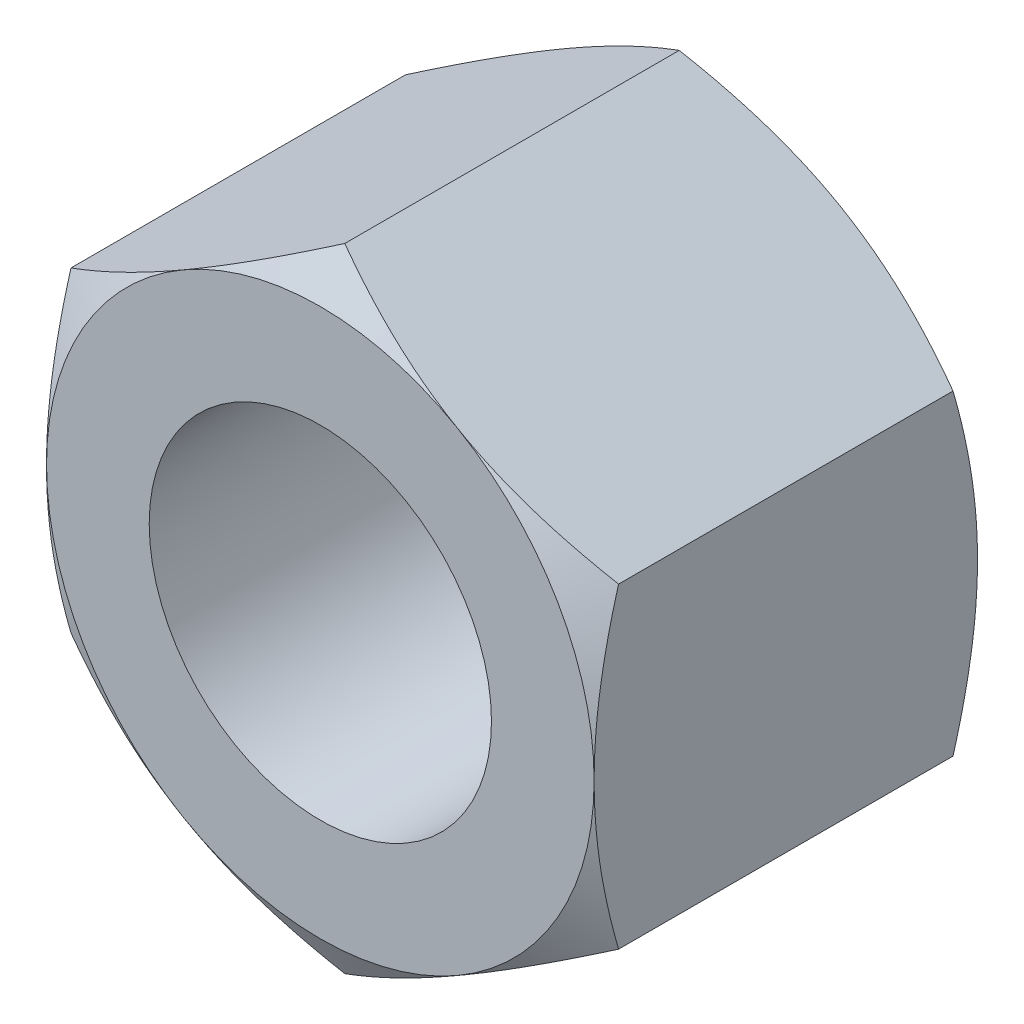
ISO-10303-21;
HEADER;
FILE_DESCRIPTION(('STEP AP214'),'2;1');
FILE_NAME('part.step','',(''),(''),'','','');
FILE_SCHEMA(('AUTOMOTIVE_DESIGN { 1 0 10303 214 1 1 1 1 }'));
ENDSEC;
DATA;
#1=APPLICATION_CONTEXT('core data for automotive mechanical design processes');
#2=APPLICATION_PROTOCOL_DEFINITION('international standard','automotive_design',2000,#1);
#3=PRODUCT_CONTEXT('',#1,'mechanical');
#4=PRODUCT('Part','Part','',(#3));
#5=PRODUCT_RELATED_PRODUCT_CATEGORY('part','',(#4));
#6=PRODUCT_DEFINITION_FORMATION('','',#4);
#7=PRODUCT_DEFINITION_CONTEXT('part definition',#1,'design');
#8=PRODUCT_DEFINITION('design','',#6,#7);
#9=PRODUCT_DEFINITION_SHAPE('','',#8);
#10=(LENGTH_UNIT() NAMED_UNIT(*) SI_UNIT(.MILLI.,.METRE.));
#11=(NAMED_UNIT(*) PLANE_ANGLE_UNIT() SI_UNIT($,.RADIAN.));
#12=(NAMED_UNIT(*) SI_UNIT($,.STERADIAN.) SOLID_ANGLE_UNIT());
#13=UNCERTAINTY_MEASURE_WITH_UNIT(LENGTH_MEASURE(1.E-05),#10,'distance_accuracy_value','');
#14=(GEOMETRIC_REPRESENTATION_CONTEXT(3) GLOBAL_UNCERTAINTY_ASSIGNED_CONTEXT((#13)) GLOBAL_UNIT_ASSIGNED_CONTEXT((#10,
#11,#12)) REPRESENTATION_CONTEXT('',''));
#15=CARTESIAN_POINT('',(0.,0.,0.));
#16=DIRECTION('',(0.,0.,1.));
#17=DIRECTION('',(1.,0.,0.));
#18=AXIS2_PLACEMENT_3D('',#15,#16,#17);
#19=CARTESIAN_POINT('',(4.,2.30940107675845,-5.6));
#20=DIRECTION('',(0.5,0.866025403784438,0.));
#21=DIRECTION('',(-0.866025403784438,0.5,0.));
#22=AXIS2_PLACEMENT_3D('',#19,#20,#21);
#23=PLANE('',#22);
#24=CARTESIAN_POINT('',(1.99999999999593,3.46410161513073,-5.59999999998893));
#25=CARTESIAN_POINT('',(2.08488877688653,3.41509105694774,-5.60001634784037));
#26=CARTESIAN_POINT('',(2.16977346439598,3.36608285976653,-5.59792016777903));
#27=CARTESIAN_POINT('',(2.33937616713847,3.26816269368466,-5.58962425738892));
#28=CARTESIAN_POINT('',(2.42409421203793,3.21925070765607,-5.58342533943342));
#29=CARTESIAN_POINT('',(2.5928164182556,3.12183889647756,-5.5670862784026));
#30=CARTESIAN_POINT('',(2.67682203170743,3.07333823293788,-5.55696597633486));
#31=CARTESIAN_POINT('',(2.84443302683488,2.97656797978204,-5.53300183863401));
#32=CARTESIAN_POINT('',(2.92803839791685,2.92829839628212,-5.5191579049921));
#33=CARTESIAN_POINT('',(3.17790759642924,2.78403634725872,-5.47246833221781));
#34=CARTESIAN_POINT('',(3.34344554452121,2.68846296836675,-5.43444225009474));
#35=CARTESIAN_POINT('',(3.67309788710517,2.49813809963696,-5.34674437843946));
#36=CARTESIAN_POINT('',(3.83720078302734,2.40339324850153,-5.29701442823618));
#37=CARTESIAN_POINT('',(3.99999992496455,2.30940112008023,-5.24273443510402));
#38=B_SPLINE_CURVE_WITH_KNOTS('',3,(#24,#25,#26,#27,#28,#29,#30,#31,#32,#33,#34,#35,#36,#37),
.UNSPECIFIED.,.F.,.F.,(4,2,2,2,2,2,4),(0.,0.294033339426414,0.588008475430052,0.880515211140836,
1.17302964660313,1.75729184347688,2.34452114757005),.UNSPECIFIED.);
#39=CARTESIAN_POINT('',(1.99999999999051,3.46410161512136,-5.60000000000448));
#40=VERTEX_POINT('',#39);
#41=CARTESIAN_POINT('',(3.99999996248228,2.30940109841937,-5.24273442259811));
#42=VERTEX_POINT('',#41);
#43=EDGE_CURVE('E276',#40,#42,#38,.T.);
#44=ORIENTED_EDGE('',*,*,#43,.F.);
#45=CARTESIAN_POINT('',(-2.88491869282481E-08,4.61880217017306,-5.24273440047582));
#46=CARTESIAN_POINT('',(0.16279912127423,4.52481003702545,-5.29701439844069));
#47=CARTESIAN_POINT('',(0.326902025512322,4.43006518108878,-5.34674435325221));
#48=CARTESIAN_POINT('',(0.656554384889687,4.23974030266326,-5.43444223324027));
#49=CARTESIAN_POINT('',(0.822092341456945,4.14416691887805,-5.47246831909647));
#50=CARTESIAN_POINT('',(1.07196155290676,3.9999048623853,-5.51915789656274));
#51=CARTESIAN_POINT('',(1.15556692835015,3.95163527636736,-5.53300183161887));
#52=CARTESIAN_POINT('',(1.32317793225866,3.85486501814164,-5.55696597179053));
#53=CARTESIAN_POINT('',(1.40718355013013,3.80636435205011,-5.56708627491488));
#54=CARTESIAN_POINT('',(1.57590576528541,3.70895253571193,-5.58342533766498));
#55=CARTESIAN_POINT('',(1.6606238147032,3.66004054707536,-5.58962425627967));
#56=CARTESIAN_POINT('',(1.83022652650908,3.56212037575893,-5.59792016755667));
#57=CARTESIAN_POINT('',(1.91511121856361,3.51311217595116,-5.60001634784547));
#58=CARTESIAN_POINT('',(1.99999999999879,3.46410161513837,-5.59999999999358));
#59=B_SPLINE_CURVE_WITH_KNOTS('',3,(#45,#46,#47,#48,#49,#50,#51,#52,#53,#54,#55,#56,#57,#58),
.UNSPECIFIED.,.F.,.F.,(4,2,2,2,2,2,4),(0.,0.587229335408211,1.17149156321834,1.46400601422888,
1.75651276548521,2.0504879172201,2.34452127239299),.UNSPECIFIED.);
#60=CARTESIAN_POINT('',(-3.75197234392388E-08,4.61880213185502,-5.24273442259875));
#61=VERTEX_POINT('',#60);
#62=EDGE_CURVE('E282',#61,#40,#59,.T.);
#63=ORIENTED_EDGE('',*,*,#62,.F.);
#64=DIRECTION('',(0.,0.,1.));
#65=VECTOR('',#64,1.);
#66=CARTESIAN_POINT('',(0.,4.61880215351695,-5.6));
#67=LINE('',#66,#65);
#68=CARTESIAN_POINT('',(3.75210383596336E-08,4.61880213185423,-0.357265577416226));
#69=VERTEX_POINT('',#68);
#70=EDGE_CURVE('E125',#69,#61,#67,.F.);
#71=ORIENTED_EDGE('',*,*,#70,.F.);
#72=CARTESIAN_POINT('',(1.99999999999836,3.46410161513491,-3.24844318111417E-11));
#73=CARTESIAN_POINT('',(1.91511122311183,3.51311217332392,1.6347817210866E-05));
#74=CARTESIAN_POINT('',(1.8302265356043,3.56212037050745,-0.0020798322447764));
#75=CARTESIAN_POINT('',(1.66062383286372,3.66004053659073,-0.0103757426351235));
#76=CARTESIAN_POINT('',(1.57590578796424,3.7089525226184,-0.016574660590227));
#77=CARTESIAN_POINT('',(1.407183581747,3.806364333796,-0.0329137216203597));
#78=CARTESIAN_POINT('',(1.32317796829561,3.85486499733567,-0.0430340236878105));
#79=CARTESIAN_POINT('',(1.15556697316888,3.95163525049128,-0.0669981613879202));
#80=CARTESIAN_POINT('',(1.07196160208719,3.99990483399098,-0.0808420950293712));
#81=CARTESIAN_POINT('',(0.822092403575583,4.14416688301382,-0.12753166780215));
#82=CARTESIAN_POINT('',(0.656554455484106,4.23974026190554,-0.165557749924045));
#83=CARTESIAN_POINT('',(0.32690211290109,4.43006513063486,-0.253255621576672));
#84=CARTESIAN_POINT('',(0.162799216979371,4.52480998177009,-0.302985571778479));
#85=CARTESIAN_POINT('',(7.50425381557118E-08,4.61880211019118,-0.35726556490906));
#86=B_SPLINE_CURVE_WITH_KNOTS('',3,(#72,#73,#74,#75,#76,#77,#78,#79,#80,#81,#82,#83,#84,#85),
.UNSPECIFIED.,.F.,.F.,(4,2,2,2,2,2,4),(0.,0.294033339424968,0.588008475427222,0.88051521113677,
1.17302964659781,1.75729184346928,2.34452114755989),.UNSPECIFIED.);
#87=CARTESIAN_POINT('',(1.99999999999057,3.46410161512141,-1.96899788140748E-11));
#88=VERTEX_POINT('',#87);
#89=EDGE_CURVE('E415',#88,#69,#86,.T.);
#90=ORIENTED_EDGE('',*,*,#89,.F.);
#91=CARTESIAN_POINT('',(4.00000000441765,2.30940103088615,-0.357265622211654));
#92=CARTESIAN_POINT('',(3.83720086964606,2.40339318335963,-0.302985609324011));
#93=CARTESIAN_POINT('',(3.6730979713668,2.49813804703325,-0.253255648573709));
#94=CARTESIAN_POINT('',(3.34344561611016,2.68846293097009,-0.16555776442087));
#95=CARTESIAN_POINT('',(3.1779076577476,2.78403631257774,-0.127531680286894));
#96=CARTESIAN_POINT('',(2.92803844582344,2.92829836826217,-0.0808421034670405));
#97=CARTESIAN_POINT('',(2.84443307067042,2.97656795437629,-0.0669981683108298));
#98=CARTESIAN_POINT('',(2.67682206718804,3.07333821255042,-0.043034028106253));
#99=CARTESIAN_POINT('',(2.59281644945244,3.12183887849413,-0.0329137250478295));
#100=CARTESIAN_POINT('',(2.42409423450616,3.21925069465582,-0.0165746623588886));
#101=CARTESIAN_POINT('',(2.33937618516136,3.26816268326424,-0.0103757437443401));
#102=CARTESIAN_POINT('',(2.16977347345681,3.36608285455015,-0.00207983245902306));
#103=CARTESIAN_POINT('',(2.08488878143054,3.4150910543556,1.63478360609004E-05));
#104=CARTESIAN_POINT('',(2.00000000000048,3.46410161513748,-3.05849096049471E-11));
#105=B_SPLINE_CURVE_WITH_KNOTS('',3,(#91,#92,#93,#94,#95,#96,#97,#98,#99,#100,#101,#102,#103,
#104),.UNSPECIFIED.,.F.,.F.,(4,2,2,2,2,2,4),(0.,0.587229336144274,1.1714915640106,
1.4640060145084,1.75651276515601,2.05048791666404,2.34452127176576),.UNSPECIFIED.);
#106=CARTESIAN_POINT('',(4.,2.30940103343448,-0.357265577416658));
#107=VERTEX_POINT('',#106);
#108=EDGE_CURVE('E406',#107,#88,#105,.T.);
#109=ORIENTED_EDGE('',*,*,#108,.F.);
#110=DIRECTION('',(0.,0.,1.));
#111=VECTOR('',#110,1.);
#112=CARTESIAN_POINT('',(4.,2.30940107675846,-5.6));
#113=LINE('',#112,#111);
#114=EDGE_CURVE('E385',#107,#42,#113,.F.);
#115=ORIENTED_EDGE('',*,*,#114,.T.);
#116=EDGE_LOOP('',(#44,#63,#71,#90,#109,#115));
#117=FACE_BOUND('',#116,.T.);
#118=ADVANCED_FACE('F17',(#117),#23,.T.);
#119=CARTESIAN_POINT('',(4.,2.30940107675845,-5.6));
#120=DIRECTION('',(-1.,0.,0.));
#121=DIRECTION('',(0.,0.,1.));
#122=AXIS2_PLACEMENT_3D('',#119,#120,#121);
#123=PLANE('',#122);
#124=DIRECTION('',(0.,0.,1.));
#125=VECTOR('',#124,1.);
#126=CARTESIAN_POINT('',(3.99999999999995,-2.30940107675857,-5.6));
#127=LINE('',#126,#125);
#128=CARTESIAN_POINT('',(3.99999999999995,-2.30940109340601,-5.24273440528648));
#129=VERTEX_POINT('',#128);
#130=CARTESIAN_POINT('',(4.00000001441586,-2.30940106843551,-0.357265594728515));
#131=VERTEX_POINT('',#130);
#132=EDGE_CURVE('E380',#129,#131,#127,.T.);
#133=ORIENTED_EDGE('',*,*,#132,.F.);
#134=CARTESIAN_POINT('',(3.99999999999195,0.,-5.59999999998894));
#135=CARTESIAN_POINT('',(3.99999999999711,-0.0980211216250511,-5.60001634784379));
#136=CARTESIAN_POINT('',(3.99999999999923,-0.196037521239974,-5.59792016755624));
#137=CARTESIAN_POINT('',(4.00000000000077,-0.391877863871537,-5.58962425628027));
#138=CARTESIAN_POINT('',(4.00000000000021,-0.489701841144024,-5.58342533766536));
#139=CARTESIAN_POINT('',(3.99999999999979,-0.684525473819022,-5.56708627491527));
#140=CARTESIAN_POINT('',(3.99999999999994,-0.781526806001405,-5.55696597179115));
#141=CARTESIAN_POINT('',(4.00000000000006,-0.975067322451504,-5.53300183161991));
#142=CARTESIAN_POINT('',(4.00000000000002,-1.07160649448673,-5.51915789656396));
#143=CARTESIAN_POINT('',(3.99999999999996,-1.36013060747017,-5.47246831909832));
#144=CARTESIAN_POINT('',(3.99999999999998,-1.5512773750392,-5.43444223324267));
#145=CARTESIAN_POINT('',(4.00000000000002,-1.93192713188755,-5.34674435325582));
#146=CARTESIAN_POINT('',(4.00000000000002,-2.12141684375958,-5.29701439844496));
#147=CARTESIAN_POINT('',(3.99999999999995,-2.3094011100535,-5.24273440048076));
#148=B_SPLINE_CURVE_WITH_KNOTS('',3,(#134,#135,#136,#137,#138,#139,#140,#141,#142,#143,#144,
#145,#146,#147),.UNSPECIFIED.,.F.,.F.,(4,2,2,2,2,2,4),(0.,0.294033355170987,0.588008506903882,
0.88051525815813,1.17302970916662,1.75729193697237,2.34452127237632),.UNSPECIFIED.);
#149=CARTESIAN_POINT('',(3.99999999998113,0.,-5.60000000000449));
#150=VERTEX_POINT('',#149);
#151=EDGE_CURVE('E248',#150,#129,#148,.T.);
#152=ORIENTED_EDGE('',*,*,#151,.F.);
#153=CARTESIAN_POINT('',(4.,2.30940111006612,-5.24273440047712));
#154=CARTESIAN_POINT('',(4.,2.12141684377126,-5.29701439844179));
#155=CARTESIAN_POINT('',(4.,1.93192713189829,-5.34674435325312));
#156=CARTESIAN_POINT('',(4.,1.55127737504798,-5.43444223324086));
#157=CARTESIAN_POINT('',(4.,1.36013060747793,-5.47246831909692));
#158=CARTESIAN_POINT('',(4.,1.07160649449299,-5.51915789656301));
#159=CARTESIAN_POINT('',(4.,0.97506732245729,-5.53300183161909));
#160=CARTESIAN_POINT('',(4.,0.781526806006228,-5.55696597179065));
#161=CARTESIAN_POINT('',(4.,0.684525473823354,-5.56708627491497));
#162=CARTESIAN_POINT('',(4.,0.489701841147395,-5.583425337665));
#163=CARTESIAN_POINT('',(4.,0.391877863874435,-5.58962425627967));
#164=CARTESIAN_POINT('',(4.,0.196037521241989,-5.59792016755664));
#165=CARTESIAN_POINT('',(4.,0.0980211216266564,-5.60001634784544));
#166=CARTESIAN_POINT('',(4.,1.28716481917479E-12,-5.59999999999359));
#167=B_SPLINE_CURVE_WITH_KNOTS('',3,(#153,#154,#155,#156,#157,#158,#159,#160,#161,#162,#163,
#164,#165,#166),.UNSPECIFIED.,.F.,.F.,(4,2,2,2,2,2,4),(0.,0.58722933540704,1.17149156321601,
1.46400601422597,1.75651276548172,2.05048791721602,2.34452127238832),.UNSPECIFIED.);
#168=EDGE_CURVE('E249',#42,#150,#167,.T.);
#169=ORIENTED_EDGE('',*,*,#168,.F.);
#170=ORIENTED_EDGE('',*,*,#114,.F.);
#171=CARTESIAN_POINT('',(3.99999999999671,0.,-3.24983095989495E-11));
#172=CARTESIAN_POINT('',(3.99999999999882,0.0980211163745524,1.63478171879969E-05));
#173=CARTESIAN_POINT('',(3.99999999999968,0.196037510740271,-0.00207983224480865));
#174=CARTESIAN_POINT('',(4.00000000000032,0.391877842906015,-0.0103757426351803));
#175=CARTESIAN_POINT('',(4.00000000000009,0.489701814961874,-0.0165746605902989));
#176=CARTESIAN_POINT('',(3.99999999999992,0.684525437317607,-0.0329137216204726));
#177=CARTESIAN_POINT('',(3.99999999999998,0.78152676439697,-0.0430340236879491));
#178=CARTESIAN_POINT('',(4.00000000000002,0.975067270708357,-0.0669981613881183));
#179=CARTESIAN_POINT('',(4.00000000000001,1.0716064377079,-0.0808420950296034));
#180=CARTESIAN_POINT('',(3.99999999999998,1.36013053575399,-0.127531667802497));
#181=CARTESIAN_POINT('',(3.99999999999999,1.55127729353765,-0.165557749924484));
#182=CARTESIAN_POINT('',(4.00000000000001,1.93192703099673,-0.253255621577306));
#183=CARTESIAN_POINT('',(4.00000000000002,2.12141673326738,-0.302985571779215));
#184=CARTESIAN_POINT('',(4.,2.30940099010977,-0.357265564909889));
#185=B_SPLINE_CURVE_WITH_KNOTS('',3,(#171,#172,#173,#174,#175,#176,#177,#178,#179,#180,#181,
#182,#183,#184),.UNSPECIFIED.,.F.,.F.,(4,2,2,2,2,2,4),(0.,0.29403333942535,0.588008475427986,
0.880515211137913,1.17302964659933,1.75729184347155,2.34452114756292),.UNSPECIFIED.);
#186=CARTESIAN_POINT('',(3.99999999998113,0.,-1.97029892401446E-11));
#187=VERTEX_POINT('',#186);
#188=EDGE_CURVE('E404',#187,#107,#185,.T.);
#189=ORIENTED_EDGE('',*,*,#188,.F.);
#190=CARTESIAN_POINT('',(3.99999999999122,-2.30940099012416,-0.357265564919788));
#191=CARTESIAN_POINT('',(3.99999999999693,-2.1214167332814,-0.302985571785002));
#192=CARTESIAN_POINT('',(3.9999999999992,-1.93192703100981,-0.253255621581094));
#193=CARTESIAN_POINT('',(4.0000000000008,-1.55127729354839,-0.165557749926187));
#194=CARTESIAN_POINT('',(4.00000000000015,-1.36013053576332,-0.1275316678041));
#195=CARTESIAN_POINT('',(3.99999999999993,-1.07160643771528,-0.0808420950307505));
#196=CARTESIAN_POINT('',(3.99999999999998,-0.975067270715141,-0.0669981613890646));
#197=CARTESIAN_POINT('',(4.00000000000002,-0.781526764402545,-0.0430340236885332));
#198=CARTESIAN_POINT('',(4.00000000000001,-0.68452543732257,-0.0329137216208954));
#199=CARTESIAN_POINT('',(3.99999999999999,-0.489701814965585,-0.0165746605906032));
#200=CARTESIAN_POINT('',(4.,-0.391877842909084,-0.0103757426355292));
#201=CARTESIAN_POINT('',(4.,-0.196037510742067,-0.00207983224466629));
#202=CARTESIAN_POINT('',(4.00000000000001,-0.098021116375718,1.63478178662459E-05));
#203=CARTESIAN_POINT('',(4.,-5.48172618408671E-13,-3.05987873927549E-11));
#204=B_SPLINE_CURVE_WITH_KNOTS('',3,(#190,#191,#192,#193,#194,#195,#196,#197,#198,#199,#200,
#201,#202,#203),.UNSPECIFIED.,.F.,.F.,(4,2,2,2,2,2,4),(0.,0.587229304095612,1.17149150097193,
1.46400593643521,1.756512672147,2.05048780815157,2.34452114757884),.UNSPECIFIED.);
#205=EDGE_CURVE('E216',#131,#187,#204,.T.);
#206=ORIENTED_EDGE('',*,*,#205,.F.);
#207=EDGE_LOOP('',(#133,#152,#169,#170,#189,#206));
#208=FACE_BOUND('',#207,.T.);
#209=ADVANCED_FACE('F225',(#208),#123,.F.);
#210=CARTESIAN_POINT('',(0.,-4.61880215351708,-5.6));
#211=DIRECTION('',(0.5,-0.866025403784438,0.));
#212=DIRECTION('',(0.866025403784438,0.5,0.));
#213=AXIS2_PLACEMENT_3D('',#210,#211,#212);
#214=PLANE('',#213);
#215=CARTESIAN_POINT('',(1.99999999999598,-3.46410161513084,-5.59999999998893));
#216=CARTESIAN_POINT('',(1.91511122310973,-3.51311217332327,-5.60001634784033));
#217=CARTESIAN_POINT('',(1.83022653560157,-3.56212037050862,-5.59792016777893));
#218=CARTESIAN_POINT('',(1.66062383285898,-3.66004053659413,-5.58962425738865));
#219=CARTESIAN_POINT('',(1.57590578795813,-3.7089525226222,-5.58342533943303));
#220=CARTESIAN_POINT('',(1.40718358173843,-3.80636433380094,-5.56708627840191));
#221=CARTESIAN_POINT('',(1.32317796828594,-3.85486499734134,-5.55696597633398));
#222=CARTESIAN_POINT('',(1.155566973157,-3.95163525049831,-5.53300183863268));
#223=CARTESIAN_POINT('',(1.0719616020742,-3.99990483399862,-5.51915790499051));
#224=CARTESIAN_POINT('',(0.822092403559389,-4.14416688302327,-5.47246833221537));
#225=CARTESIAN_POINT('',(0.656554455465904,-4.23974026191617,-5.43444225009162));
#226=CARTESIAN_POINT('',(0.326902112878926,-4.43006513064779,-5.34674437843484));
#227=CARTESIAN_POINT('',(0.162799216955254,-4.52480998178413,-5.29701442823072));
#228=CARTESIAN_POINT('',(7.50165138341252E-08,-4.61880211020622,-5.2427344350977));
#229=B_SPLINE_CURVE_WITH_KNOTS('',3,(#215,#216,#217,#218,#219,#220,#221,#222,#223,#224,#225,
#226,#227,#228),.UNSPECIFIED.,.F.,.F.,(4,2,2,2,2,2,4),(0.,0.294033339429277,0.588008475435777,
0.880515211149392,1.17302964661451,1.7572918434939,2.34452114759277),.UNSPECIFIED.);
#230=CARTESIAN_POINT('',(1.99999999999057,-3.46410161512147,-5.60000000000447));
#231=VERTEX_POINT('',#230);
#232=CARTESIAN_POINT('',(3.75087773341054E-08,-4.61880213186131,-5.24273442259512));
#233=VERTEX_POINT('',#232);
#234=EDGE_CURVE('E231',#231,#233,#229,.T.);
#235=ORIENTED_EDGE('',*,*,#234,.F.);
#236=CARTESIAN_POINT('',(3.99999992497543,-2.30940112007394,-5.24273443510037));
#237=CARTESIAN_POINT('',(3.83720078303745,-2.40339324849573,-5.29701442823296));
#238=CARTESIAN_POINT('',(3.67309788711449,-2.49813809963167,-5.34674437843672));
#239=CARTESIAN_POINT('',(3.34344554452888,-2.68846296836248,-5.43444225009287));
#240=CARTESIAN_POINT('',(3.17790759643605,-2.78403634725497,-5.47246833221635));
#241=CARTESIAN_POINT('',(2.92803839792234,-2.92829839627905,-5.51915790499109));
#242=CARTESIAN_POINT('',(2.84443302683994,-2.97656797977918,-5.53300183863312));
#243=CARTESIAN_POINT('',(2.67682203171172,-3.07333823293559,-5.5569659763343));
#244=CARTESIAN_POINT('',(2.59281641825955,-3.12183889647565,-5.56708627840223));
#245=CARTESIAN_POINT('',(2.42409421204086,-3.21925070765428,-5.583425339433));
#246=CARTESIAN_POINT('',(2.3393761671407,-3.2681626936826,-5.58962425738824));
#247=CARTESIAN_POINT('',(2.16977346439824,-3.36608285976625,-5.59792016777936));
#248=CARTESIAN_POINT('',(2.0848887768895,-3.41509105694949,-5.60001634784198));
#249=CARTESIAN_POINT('',(2.00000000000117,-3.46410161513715,-5.59999999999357));
#250=B_SPLINE_CURVE_WITH_KNOTS('',3,(#236,#237,#238,#239,#240,#241,#242,#243,#244,#245,#246,
#247,#248,#249),.UNSPECIFIED.,.F.,.F.,(4,2,2,2,2,2,4),(0.,0.587229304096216,1.17149150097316,
1.4640059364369,1.75651267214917,2.05048780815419,2.34452114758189),.UNSPECIFIED.);
#251=EDGE_CURVE('E241',#129,#231,#250,.T.);
#252=ORIENTED_EDGE('',*,*,#251,.F.);
#253=ORIENTED_EDGE('',*,*,#132,.T.);
#254=CARTESIAN_POINT('',(1.99999999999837,-3.46410161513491,-3.24931054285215E-11));
#255=CARTESIAN_POINT('',(2.08488878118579,-3.41509105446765,1.6347820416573E-05));
#256=CARTESIAN_POINT('',(2.16977347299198,-3.36608285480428,-0.00207983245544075));
#257=CARTESIAN_POINT('',(2.33937618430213,-3.26816268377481,-0.0103757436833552));
#258=CARTESIAN_POINT('',(2.42409423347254,-3.21925069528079,-0.0165746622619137));
#259=CARTESIAN_POINT('',(2.59281644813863,-3.12183887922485,-0.0329137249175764));
#260=CARTESIAN_POINT('',(2.67682206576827,-3.07333821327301,-0.0430340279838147));
#261=CARTESIAN_POINT('',(2.84443306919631,-2.97656795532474,-0.0669981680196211));
#262=CARTESIAN_POINT('',(2.92803844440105,-2.92829836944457,-0.0808421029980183));
#263=CARTESIAN_POINT('',(3.17790765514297,-2.78403631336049,-0.127531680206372));
#264=CARTESIAN_POINT('',(3.34344561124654,-2.68846292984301,-0.165557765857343));
#265=CARTESIAN_POINT('',(3.67309796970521,-2.49813805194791,-0.253255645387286));
#266=CARTESIAN_POINT('',(3.83720087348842,-2.40339319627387,-0.30298559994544));
#267=CARTESIAN_POINT('',(4.00000002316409,-2.30940106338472,-0.357265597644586));
#268=B_SPLINE_CURVE_WITH_KNOTS('',3,(#254,#255,#256,#257,#258,#259,#260,#261,#262,#263,#264,
#265,#266,#267),.UNSPECIFIED.,.F.,.F.,(4,2,2,2,2,2,4),(0.,0.294033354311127,0.588008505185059,
0.880515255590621,1.17302970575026,1.75729193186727,2.34452126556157),.UNSPECIFIED.);
#269=CARTESIAN_POINT('',(1.99999999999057,-3.46410161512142,-1.96925808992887E-11));
#270=VERTEX_POINT('',#269);
#271=EDGE_CURVE('E209',#270,#131,#268,.T.);
#272=ORIENTED_EDGE('',*,*,#271,.F.);
#273=CARTESIAN_POINT('',(-4.19348930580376E-08,-4.61880213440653,-0.357265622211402));
#274=CARTESIAN_POINT('',(0.162799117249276,-4.52481002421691,-0.302985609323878));
#275=CARTESIAN_POINT('',(0.326902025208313,-4.43006517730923,-0.253255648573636));
#276=CARTESIAN_POINT('',(0.656554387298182,-4.23974030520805,-0.165557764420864));
#277=CARTESIAN_POINT('',(0.822092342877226,-4.14416691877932,-0.127531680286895));
#278=CARTESIAN_POINT('',(1.07196155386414,-3.99990486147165,-0.0808421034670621));
#279=CARTESIAN_POINT('',(1.15556692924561,-3.95163527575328,-0.0669981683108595));
#280=CARTESIAN_POINT('',(1.32317793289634,-3.85486501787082,-0.0430340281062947));
#281=CARTESIAN_POINT('',(1.40718355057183,-3.80636435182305,-0.032913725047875));
#282=CARTESIAN_POINT('',(1.57590576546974,-3.70895253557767,-0.0165746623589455));
#283=CARTESIAN_POINT('',(1.66062381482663,-3.66004054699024,-0.0103757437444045));
#284=CARTESIAN_POINT('',(1.83022652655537,-3.56212037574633,-0.002079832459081));
#285=CARTESIAN_POINT('',(1.91511121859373,-3.51311217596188,1.6347836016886E-05));
#286=CARTESIAN_POINT('',(1.99999999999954,-3.46410161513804,-3.0591848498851E-11));
#287=B_SPLINE_CURVE_WITH_KNOTS('',3,(#273,#274,#275,#276,#277,#278,#279,#280,#281,#282,#283,
#284,#285,#286),.UNSPECIFIED.,.F.,.F.,(4,2,2,2,2,2,4),(0.,0.587229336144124,1.17149156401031,
1.46400601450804,1.75651276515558,2.05048791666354,2.34452127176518),.UNSPECIFIED.);
#288=CARTESIAN_POINT('',(-3.75194701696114E-08,-4.61880213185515,-0.357265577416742));
#289=VERTEX_POINT('',#288);
#290=EDGE_CURVE('E181',#289,#270,#287,.T.);
#291=ORIENTED_EDGE('',*,*,#290,.F.);
#292=DIRECTION('',(0.,0.,1.));
#293=VECTOR('',#292,1.);
#294=CARTESIAN_POINT('',(0.,-4.61880215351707,-5.6));
#295=LINE('',#294,#293);
#296=EDGE_CURVE('E361',#233,#289,#295,.T.);
#297=ORIENTED_EDGE('',*,*,#296,.F.);
#298=EDGE_LOOP('',(#235,#252,#253,#272,#291,#297));
#299=FACE_BOUND('',#298,.T.);
#300=ADVANCED_FACE('F222',(#299),#214,.T.);
#301=CARTESIAN_POINT('',(-4.00000000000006,-2.30940107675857,-5.6));
#302=DIRECTION('',(-0.5,-0.866025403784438,0.));
#303=DIRECTION('',(0.866025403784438,-0.5,0.));
#304=AXIS2_PLACEMENT_3D('',#301,#302,#303);
#305=PLANE('',#304);
#306=CARTESIAN_POINT('',(-1.99999999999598,-3.46410161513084,-5.59999999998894));
#307=CARTESIAN_POINT('',(-2.08488877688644,-3.41509105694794,-5.60001634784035));
#308=CARTESIAN_POINT('',(-2.16977346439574,-3.36608285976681,-5.597920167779));
#309=CARTESIAN_POINT('',(-2.33937616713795,-3.26816269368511,-5.58962425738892));
#310=CARTESIAN_POINT('',(-2.42409421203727,-3.21925070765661,-5.58342533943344));
#311=CARTESIAN_POINT('',(-2.59281641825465,-3.12183889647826,-5.56708627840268));
#312=CARTESIAN_POINT('',(-2.67682203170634,-3.07333823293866,-5.55696597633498));
#313=CARTESIAN_POINT('',(-2.84443302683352,-2.97656797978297,-5.5330018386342));
#314=CARTESIAN_POINT('',(-2.92803839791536,-2.92829839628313,-5.51915790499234));
#315=CARTESIAN_POINT('',(-3.17790759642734,-2.78403634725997,-5.4724683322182));
#316=CARTESIAN_POINT('',(-3.34344554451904,-2.68846296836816,-5.43444225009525));
#317=CARTESIAN_POINT('',(-3.67309788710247,-2.49813809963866,-5.34674437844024));
#318=CARTESIAN_POINT('',(-3.83720078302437,-2.40339324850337,-5.29701442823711));
#319=CARTESIAN_POINT('',(-3.99999992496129,-2.30940112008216,-5.24273443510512));
#320=B_SPLINE_CURVE_WITH_KNOTS('',3,(#306,#307,#308,#309,#310,#311,#312,#313,#314,#315,#316,
#317,#318,#319),.UNSPECIFIED.,.F.,.F.,(4,2,2,2,2,2,4),(0.,0.294033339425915,0.588008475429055,
0.88051521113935,1.17302964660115,1.75729184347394,2.34452114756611),.UNSPECIFIED.);
#321=CARTESIAN_POINT('',(-1.99999999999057,-3.46410161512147,-5.60000000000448));
#322=VERTEX_POINT('',#321);
#323=CARTESIAN_POINT('',(-3.99999996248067,-2.30940109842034,-5.24273442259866));
#324=VERTEX_POINT('',#323);
#325=EDGE_CURVE('E21',#322,#324,#320,.T.);
#326=ORIENTED_EDGE('',*,*,#325,.F.);
#327=CARTESIAN_POINT('',(2.88651151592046E-08,-4.61880217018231,-5.24273440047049));
#328=CARTESIAN_POINT('',(-0.162799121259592,-4.52481003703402,-5.29701439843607));
#329=CARTESIAN_POINT('',(-0.326902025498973,-4.43006518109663,-5.34674435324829));
#330=CARTESIAN_POINT('',(-0.656554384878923,-4.23974030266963,-5.43444223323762));
#331=CARTESIAN_POINT('',(-0.822092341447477,-4.14416691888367,-5.4724683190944));
#332=CARTESIAN_POINT('',(-1.07196155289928,-3.99990486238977,-5.51915789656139));
#333=CARTESIAN_POINT('',(-1.15556692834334,-3.95163527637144,-5.53300183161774));
#334=CARTESIAN_POINT('',(-1.3231779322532,-3.85486501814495,-5.55696597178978));
#335=CARTESIAN_POINT('',(-1.40718355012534,-3.80636435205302,-5.56708627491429));
#336=CARTESIAN_POINT('',(-1.57590576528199,-3.70895253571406,-5.58342533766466));
#337=CARTESIAN_POINT('',(-1.66062381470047,-3.66004054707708,-5.58962425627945));
#338=CARTESIAN_POINT('',(-1.83022652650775,-3.56212037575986,-5.59792016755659));
#339=CARTESIAN_POINT('',(-1.91511121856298,-3.51311217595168,-5.60001634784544));
#340=CARTESIAN_POINT('',(-1.99999999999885,-3.46410161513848,-5.59999999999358));
#341=B_SPLINE_CURVE_WITH_KNOTS('',3,(#327,#328,#329,#330,#331,#332,#333,#334,#335,#336,#337,
#338,#339,#340),.UNSPECIFIED.,.F.,.F.,(4,2,2,2,2,2,4),(0.,0.587229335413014,1.17149156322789,
1.46400601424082,1.75651276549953,2.05048791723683,2.34452127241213),.UNSPECIFIED.);
#342=EDGE_CURVE('E110',#233,#322,#341,.T.);
#343=ORIENTED_EDGE('',*,*,#342,.F.);
#344=ORIENTED_EDGE('',*,*,#296,.T.);
#345=CARTESIAN_POINT('',(-1.99999999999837,-3.46410161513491,-3.25061158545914E-11));
#346=CARTESIAN_POINT('',(-1.91511122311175,-3.51311217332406,1.63478171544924E-05));
#347=CARTESIAN_POINT('',(-1.83022653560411,-3.5621203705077,-0.00207983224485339));
#348=CARTESIAN_POINT('',(-1.66062383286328,-3.66004053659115,-0.0103757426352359));
#349=CARTESIAN_POINT('',(-1.57590578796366,-3.70895252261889,-0.0165746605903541));
#350=CARTESIAN_POINT('',(-1.40718358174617,-3.80636433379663,-0.0329137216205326));
#351=CARTESIAN_POINT('',(-1.32317796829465,-3.85486499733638,-0.0430340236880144));
#352=CARTESIAN_POINT('',(-1.15556697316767,-3.95163525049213,-0.0669981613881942));
#353=CARTESIAN_POINT('',(-1.07196160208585,-3.9999048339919,-0.0808420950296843));
#354=CARTESIAN_POINT('',(-0.822092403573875,-4.14416688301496,-0.127531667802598));
#355=CARTESIAN_POINT('',(-0.656554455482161,-4.23974026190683,-0.165557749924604));
#356=CARTESIAN_POINT('',(-0.326902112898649,-4.43006513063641,-0.253255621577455));
#357=CARTESIAN_POINT('',(-0.162799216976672,-4.52480998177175,-0.302985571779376));
#358=CARTESIAN_POINT('',(-7.50395544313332E-08,-4.61880211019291,-0.357265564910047));
#359=B_SPLINE_CURVE_WITH_KNOTS('',3,(#345,#346,#347,#348,#349,#350,#351,#352,#353,#354,#355,
#356,#357,#358),.UNSPECIFIED.,.F.,.F.,(4,2,2,2,2,2,4),(0.,0.294033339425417,0.588008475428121,
0.880515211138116,1.1730296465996,1.75729184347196,2.34452114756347),.UNSPECIFIED.);
#360=CARTESIAN_POINT('',(-1.99999999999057,-3.46410161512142,-1.97064586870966E-11));
#361=VERTEX_POINT('',#360);
#362=EDGE_CURVE('E202',#361,#289,#359,.T.);
#363=ORIENTED_EDGE('',*,*,#362,.F.);
#364=CARTESIAN_POINT('',(-4.00000000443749,-2.30940103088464,-0.35726562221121));
#365=CARTESIAN_POINT('',(-3.83720086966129,-2.40339318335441,-0.302985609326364));
#366=CARTESIAN_POINT('',(-3.67309797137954,-2.49813804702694,-0.253255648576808));
#367=CARTESIAN_POINT('',(-3.34344561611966,-2.68846293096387,-0.165557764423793));
#368=CARTESIAN_POINT('',(-3.17790765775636,-2.78403631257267,-0.127531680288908));
#369=CARTESIAN_POINT('',(-2.92803844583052,-2.92829836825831,-0.0808421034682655));
#370=CARTESIAN_POINT('',(-2.84443307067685,-2.97656795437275,-0.0669981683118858));
#371=CARTESIAN_POINT('',(-2.67682206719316,-3.07333821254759,-0.0430340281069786));
#372=CARTESIAN_POINT('',(-2.59281644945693,-3.12183887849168,-0.032913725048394));
#373=CARTESIAN_POINT('',(-2.42409423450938,-3.21925069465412,-0.0165746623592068));
#374=CARTESIAN_POINT('',(-2.33937618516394,-3.26816268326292,-0.0103757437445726));
#375=CARTESIAN_POINT('',(-2.16977347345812,-3.36608285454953,-0.00207983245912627));
#376=CARTESIAN_POINT('',(-2.08488878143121,-3.41509105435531,1.63478360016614E-05));
#377=CARTESIAN_POINT('',(-2.00000000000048,-3.46410161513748,-3.06048589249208E-11));
#378=B_SPLINE_CURVE_WITH_KNOTS('',3,(#364,#365,#366,#367,#368,#369,#370,#371,#372,#373,#374,
#375,#376,#377),.UNSPECIFIED.,.F.,.F.,(4,2,2,2,2,2,4),(0.,0.587229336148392,1.17149156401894,
1.464006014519,1.75651276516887,2.0504879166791,2.344521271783),.UNSPECIFIED.);
#379=CARTESIAN_POINT('',(-4.,-2.30940103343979,-0.357265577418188));
#380=VERTEX_POINT('',#379);
#381=EDGE_CURVE('E135',#380,#361,#378,.T.);
#382=ORIENTED_EDGE('',*,*,#381,.F.);
#383=DIRECTION('',(0.,0.,1.));
#384=VECTOR('',#383,1.);
#385=CARTESIAN_POINT('',(-4.00000000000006,-2.30940107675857,-5.6));
#386=LINE('',#385,#384);
#387=EDGE_CURVE('E126',#324,#380,#386,.T.);
#388=ORIENTED_EDGE('',*,*,#387,.F.);
#389=EDGE_LOOP('',(#326,#343,#344,#363,#382,#388));
#390=FACE_BOUND('',#389,.T.);
#391=ADVANCED_FACE('F160',(#390),#305,.T.);
#392=CARTESIAN_POINT('',(-4.,2.30940107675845,-5.6));
#393=DIRECTION('',(-1.,0.,0.));
#394=DIRECTION('',(0.,0.,1.));
#395=AXIS2_PLACEMENT_3D('',#392,#393,#394);
#396=PLANE('',#395);
#397=CARTESIAN_POINT('',(-3.99999999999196,0.,-5.59999999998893));
#398=CARTESIAN_POINT('',(-3.99999999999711,0.0980211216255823,-5.60001634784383));
#399=CARTESIAN_POINT('',(-3.99999999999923,0.196037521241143,-5.59792016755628));
#400=CARTESIAN_POINT('',(-4.00000000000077,0.391877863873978,-5.58962425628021));
#401=CARTESIAN_POINT('',(-4.00000000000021,0.489701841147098,-5.58342533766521));
#402=CARTESIAN_POINT('',(-3.99999999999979,0.684525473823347,-5.56708627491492));
#403=CARTESIAN_POINT('',(-3.99999999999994,0.781526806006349,-5.55696597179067));
#404=CARTESIAN_POINT('',(-4.00000000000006,0.975067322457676,-5.53300183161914));
#405=CARTESIAN_POINT('',(-4.00000000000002,1.07160649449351,-5.51915789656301));
#406=CARTESIAN_POINT('',(-3.99999999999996,1.36013060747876,-5.47246831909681));
#407=CARTESIAN_POINT('',(-3.99999999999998,1.55127737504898,-5.43444223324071));
#408=CARTESIAN_POINT('',(-4.00000000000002,1.93192713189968,-5.34674435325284));
#409=CARTESIAN_POINT('',(-4.00000000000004,2.12141684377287,-5.29701439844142));
#410=CARTESIAN_POINT('',(-4.,2.30940111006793,-5.2427344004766));
#411=B_SPLINE_CURVE_WITH_KNOTS('',3,(#397,#398,#399,#400,#401,#402,#403,#404,#405,#406,#407,
#408,#409,#410),.UNSPECIFIED.,.F.,.F.,(4,2,2,2,2,2,4),(0.,0.2940333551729,0.588008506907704,
0.880515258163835,1.17302970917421,1.75729193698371,2.34452127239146),.UNSPECIFIED.);
#412=CARTESIAN_POINT('',(-3.99999999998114,0.,-5.60000000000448));
#413=VERTEX_POINT('',#412);
#414=CARTESIAN_POINT('',(-4.,2.30940109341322,-5.2427344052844));
#415=VERTEX_POINT('',#414);
#416=EDGE_CURVE('E167',#413,#415,#411,.T.);
#417=ORIENTED_EDGE('',*,*,#416,.F.);
#418=CARTESIAN_POINT('',(-4.00000000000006,-2.30940111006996,-5.24273440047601));
#419=CARTESIAN_POINT('',(-4.00000000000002,-2.12141684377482,-5.29701439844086));
#420=CARTESIAN_POINT('',(-4.00000000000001,-1.93192713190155,-5.34674435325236));
#421=CARTESIAN_POINT('',(-3.99999999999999,-1.55127737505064,-5.43444223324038));
#422=CARTESIAN_POINT('',(-4.,-1.36013060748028,-5.47246831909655));
#423=CARTESIAN_POINT('',(-4.,-1.07160649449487,-5.5191578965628));
#424=CARTESIAN_POINT('',(-4.,-0.975067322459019,-5.53300183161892));
#425=CARTESIAN_POINT('',(-4.,-0.781526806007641,-5.55696597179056));
#426=CARTESIAN_POINT('',(-4.,-0.684525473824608,-5.56708627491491));
#427=CARTESIAN_POINT('',(-4.,-0.489701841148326,-5.58342533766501));
#428=CARTESIAN_POINT('',(-4.,-0.391877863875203,-5.5896242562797));
#429=CARTESIAN_POINT('',(-4.,-0.196037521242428,-5.59792016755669));
#430=CARTESIAN_POINT('',(-4.,-0.0980211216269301,-5.60001634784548));
#431=CARTESIAN_POINT('',(-4.,-1.39471767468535E-12,-5.59999999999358));
#432=B_SPLINE_CURVE_WITH_KNOTS('',3,(#418,#419,#420,#421,#422,#423,#424,#425,#426,#427,#428,
#429,#430,#431),.UNSPECIFIED.,.F.,.F.,(4,2,2,2,2,2,4),(0.,0.58722933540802,1.17149156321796,
1.4640060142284,1.75651276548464,2.05048791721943,2.34452127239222),.UNSPECIFIED.);
#433=EDGE_CURVE('E298',#324,#413,#432,.T.);
#434=ORIENTED_EDGE('',*,*,#433,.F.);
#435=ORIENTED_EDGE('',*,*,#387,.T.);
#436=CARTESIAN_POINT('',(-3.99999999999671,0.,-3.24852991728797E-11));
#437=CARTESIAN_POINT('',(-3.99999999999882,-0.098021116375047,1.63478171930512E-05));
#438=CARTESIAN_POINT('',(-3.99999999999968,-0.19603751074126,-0.00207983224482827));
#439=CARTESIAN_POINT('',(-4.00000000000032,-0.39187784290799,-0.0103757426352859));
#440=CARTESIAN_POINT('',(-4.00000000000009,-0.489701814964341,-0.0165746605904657));
#441=CARTESIAN_POINT('',(-3.99999999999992,-0.684525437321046,-0.0329137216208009));
#442=CARTESIAN_POINT('',(-3.99999999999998,-0.78152676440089,-0.0430340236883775));
#443=CARTESIAN_POINT('',(-4.00000000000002,-0.975067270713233,-0.0669981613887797));
#444=CARTESIAN_POINT('',(-4.00000000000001,-1.07160643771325,-0.0808420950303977));
#445=CARTESIAN_POINT('',(-3.99999999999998,-1.36013053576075,-0.127531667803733));
#446=CARTESIAN_POINT('',(-3.99999999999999,-1.55127729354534,-0.165557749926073));
#447=CARTESIAN_POINT('',(-4.00000000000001,-1.93192703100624,-0.25325562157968));
#448=CARTESIAN_POINT('',(-4.00000000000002,-2.1214167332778,-0.302985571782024));
#449=CARTESIAN_POINT('',(-4.,-2.30940099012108,-0.357265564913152));
#450=B_SPLINE_CURVE_WITH_KNOTS('',3,(#436,#437,#438,#439,#440,#441,#442,#443,#444,#445,#446,
#447,#448,#449),.UNSPECIFIED.,.F.,.F.,(4,2,2,2,2,2,4),(0.,0.294033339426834,0.588008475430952,
0.880515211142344,1.17302964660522,1.75729184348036,2.34452114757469),.UNSPECIFIED.);
#451=CARTESIAN_POINT('',(-3.99999999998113,0.,-1.96899788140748E-11));
#452=VERTEX_POINT('',#451);
#453=EDGE_CURVE('E134',#452,#380,#450,.T.);
#454=ORIENTED_EDGE('',*,*,#453,.F.);
#455=CARTESIAN_POINT('',(-4.,2.30940099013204,-0.35726556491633));
#456=CARTESIAN_POINT('',(-4.,2.12141673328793,-0.30298557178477));
#457=CARTESIAN_POINT('',(-4.,1.93192703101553,-0.253255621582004));
#458=CARTESIAN_POINT('',(-4.,1.55127729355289,-0.165557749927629));
#459=CARTESIAN_POINT('',(-4.,1.36013053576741,-0.127531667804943));
#460=CARTESIAN_POINT('',(-4.,1.07160643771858,-0.0808420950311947));
#461=CARTESIAN_POINT('',(-4.,0.975067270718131,-0.0669981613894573));
#462=CARTESIAN_POINT('',(-4.,0.781526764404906,-0.0430340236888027));
#463=CARTESIAN_POINT('',(-4.,0.684525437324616,-0.0329137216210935));
#464=CARTESIAN_POINT('',(-4.,0.489701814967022,-0.0165746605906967));
#465=CARTESIAN_POINT('',(-4.,0.391877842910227,-0.0103757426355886));
#466=CARTESIAN_POINT('',(-4.,0.196037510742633,-0.00207983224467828));
#467=CARTESIAN_POINT('',(-4.,0.0980211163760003,1.63478178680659E-05));
#468=CARTESIAN_POINT('',(-4.,5.48172618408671E-13,-3.0585776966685E-11));
#469=B_SPLINE_CURVE_WITH_KNOTS('',3,(#455,#456,#457,#458,#459,#460,#461,#462,#463,#464,#465,
#466,#467,#468),.UNSPECIFIED.,.F.,.F.,(4,2,2,2,2,2,4),(0.,0.587229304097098,1.17149150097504,
1.46400593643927,1.75651267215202,2.05048780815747,2.34452114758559),.UNSPECIFIED.);
#470=CARTESIAN_POINT('',(-4.00000001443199,2.30940106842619,-0.357265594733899));
#471=VERTEX_POINT('',#470);
#472=EDGE_CURVE('E42',#471,#452,#469,.T.);
#473=ORIENTED_EDGE('',*,*,#472,.F.);
#474=DIRECTION('',(0.,0.,1.));
#475=VECTOR('',#474,1.);
#476=CARTESIAN_POINT('',(-4.,2.30940107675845,-5.6));
#477=LINE('',#476,#475);
#478=EDGE_CURVE('E116',#415,#471,#477,.T.);
#479=ORIENTED_EDGE('',*,*,#478,.F.);
#480=EDGE_LOOP('',(#417,#434,#435,#454,#473,#479));
#481=FACE_BOUND('',#480,.T.);
#482=ADVANCED_FACE('F132',(#481),#396,.T.);
#483=CARTESIAN_POINT('',(0.,4.61880215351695,-5.6));
#484=DIRECTION('',(-0.5,0.866025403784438,0.));
#485=DIRECTION('',(-0.866025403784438,-0.5,0.));
#486=AXIS2_PLACEMENT_3D('',#483,#484,#485);
#487=PLANE('',#486);
#488=CARTESIAN_POINT('',(-1.99999999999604,3.46410161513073,-5.59999999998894));
#489=CARTESIAN_POINT('',(-1.91511122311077,3.51311217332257,-5.60001634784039));
#490=CARTESIAN_POINT('',(-1.83022653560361,3.56212037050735,-5.59792016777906));
#491=CARTESIAN_POINT('',(-1.66062383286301,3.66004053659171,-5.58962425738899));
#492=CARTESIAN_POINT('',(-1.57590578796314,3.70895252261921,-5.5834253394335));
#493=CARTESIAN_POINT('',(-1.4071835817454,3.80636433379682,-5.56708627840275));
#494=CARTESIAN_POINT('',(-1.32317796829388,3.85486499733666,-5.55696597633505));
#495=CARTESIAN_POINT('',(-1.15556697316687,3.95163525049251,-5.53300183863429));
#496=CARTESIAN_POINT('',(-1.07196160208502,3.99990483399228,-5.51915790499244));
#497=CARTESIAN_POINT('',(-0.822092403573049,4.14416688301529,-5.47246833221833));
#498=CARTESIAN_POINT('',(-0.656554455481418,4.23974026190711,-5.4344422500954));
#499=CARTESIAN_POINT('',(-0.326902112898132,4.43006513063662,-5.34674437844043));
#500=CARTESIAN_POINT('',(-0.162799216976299,4.52480998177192,-5.29701442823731));
#501=CARTESIAN_POINT('',(-7.50393948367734E-08,4.61880211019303,-5.24273443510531));
#502=B_SPLINE_CURVE_WITH_KNOTS('',3,(#488,#489,#490,#491,#492,#493,#494,#495,#496,#497,#498,
#499,#500,#501),.UNSPECIFIED.,.F.,.F.,(4,2,2,2,2,2,4),(0.,0.294033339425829,0.588008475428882,
0.880515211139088,1.1730296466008,1.75729184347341,2.34452114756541),.UNSPECIFIED.);
#503=CARTESIAN_POINT('',(-1.99999999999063,3.46410161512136,-5.60000000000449));
#504=VERTEX_POINT('',#503);
#505=EDGE_CURVE('E287',#504,#61,#502,.T.);
#506=ORIENTED_EDGE('',*,*,#505,.F.);
#507=CARTESIAN_POINT('',(-3.99999992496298,2.30940112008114,-5.24273443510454));
#508=CARTESIAN_POINT('',(-3.83720078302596,2.4033932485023,-5.2970144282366));
#509=CARTESIAN_POINT('',(-3.673097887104,2.49813809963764,-5.34674437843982));
#510=CARTESIAN_POINT('',(-3.34344554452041,2.68846296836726,-5.43444225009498));
#511=CARTESIAN_POINT('',(-3.17790759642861,2.78403634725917,-5.47246833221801));
#512=CARTESIAN_POINT('',(-2.92803839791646,2.92829839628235,-5.51915790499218));
#513=CARTESIAN_POINT('',(-2.84443302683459,2.97656797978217,-5.53300183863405));
#514=CARTESIAN_POINT('',(-2.67682203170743,3.07333823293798,-5.55696597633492));
#515=CARTESIAN_POINT('',(-2.59281641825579,3.12183889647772,-5.56708627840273));
#516=CARTESIAN_POINT('',(-2.42409421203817,3.21925070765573,-5.58342533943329));
#517=CARTESIAN_POINT('',(-2.33937616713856,3.26816269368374,-5.58962425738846));
#518=CARTESIAN_POINT('',(-2.16977346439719,3.36608285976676,-5.59792016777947));
#519=CARTESIAN_POINT('',(-2.084888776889,3.41509105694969,-5.60001634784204));
#520=CARTESIAN_POINT('',(-2.00000000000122,3.46410161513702,-5.59999999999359));
#521=B_SPLINE_CURVE_WITH_KNOTS('',3,(#507,#508,#509,#510,#511,#512,#513,#514,#515,#516,#517,
#518,#519,#520),.UNSPECIFIED.,.F.,.F.,(4,2,2,2,2,2,4),(0.,0.587229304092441,1.17149150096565,
1.46400593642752,1.75651267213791,2.05048780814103,2.34452114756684),.UNSPECIFIED.);
#522=EDGE_CURVE('E121',#415,#504,#521,.T.);
#523=ORIENTED_EDGE('',*,*,#522,.F.);
#524=ORIENTED_EDGE('',*,*,#478,.T.);
#525=CARTESIAN_POINT('',(-1.99999999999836,3.4641016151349,-3.24983095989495E-11));
#526=CARTESIAN_POINT('',(-2.08488878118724,3.41509105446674,1.63478204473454E-05));
#527=CARTESIAN_POINT('',(-2.1697734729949,3.3660828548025,-0.00207983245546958));
#528=CARTESIAN_POINT('',(-2.33937618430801,3.26816268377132,-0.0103757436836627));
#529=CARTESIAN_POINT('',(-2.42409423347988,3.21925069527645,-0.0165746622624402));
#530=CARTESIAN_POINT('',(-2.5928164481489,3.12183887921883,-0.0329137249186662));
#531=CARTESIAN_POINT('',(-2.67682206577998,3.07333821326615,-0.0430340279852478));
#532=CARTESIAN_POINT('',(-2.84443306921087,2.97656795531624,-0.0669981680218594));
#533=CARTESIAN_POINT('',(-2.92803844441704,2.92829836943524,-0.0808421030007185));
#534=CARTESIAN_POINT('',(-3.17790765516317,2.78403631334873,-0.127531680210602));
#535=CARTESIAN_POINT('',(-3.34344561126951,2.68846292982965,-0.165557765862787));
#536=CARTESIAN_POINT('',(-3.67309796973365,2.4981380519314,-0.253255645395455));
#537=CARTESIAN_POINT('',(-3.83720087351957,2.40339319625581,-0.302985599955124));
#538=CARTESIAN_POINT('',(-4.00000002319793,2.30940106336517,-0.357265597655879));
#539=B_SPLINE_CURVE_WITH_KNOTS('',3,(#525,#526,#527,#528,#529,#530,#531,#532,#533,#534,#535,
#536,#537,#538),.UNSPECIFIED.,.F.,.F.,(4,2,2,2,2,2,4),(0.,0.294033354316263,0.588008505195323,
0.880515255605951,1.17302970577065,1.75729193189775,2.34452126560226),.UNSPECIFIED.);
#540=CARTESIAN_POINT('',(-1.99999999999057,3.46410161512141,-1.97029892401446E-11));
#541=VERTEX_POINT('',#540);
#542=EDGE_CURVE('E120',#541,#471,#539,.T.);
#543=ORIENTED_EDGE('',*,*,#542,.F.);
#544=CARTESIAN_POINT('',(4.19384561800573E-08,4.61880213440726,-0.357265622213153));
#545=CARTESIAN_POINT('',(-0.162799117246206,4.52481002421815,-0.302985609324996));
#546=CARTESIAN_POINT('',(-0.326902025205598,4.43006517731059,-0.25325564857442));
#547=CARTESIAN_POINT('',(-0.656554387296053,4.2397403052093,-0.165557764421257));
#548=CARTESIAN_POINT('',(-0.822092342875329,4.14416691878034,-0.127531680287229));
#549=CARTESIAN_POINT('',(-1.07196155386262,3.99990486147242,-0.080842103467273));
#550=CARTESIAN_POINT('',(-1.15556692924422,3.95163527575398,-0.0669981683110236));
#551=CARTESIAN_POINT('',(-1.32317793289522,3.85486501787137,-0.0430340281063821));
#552=CARTESIAN_POINT('',(-1.40718355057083,3.80636435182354,-0.0329137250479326));
#553=CARTESIAN_POINT('',(-1.575905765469,3.70895253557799,-0.0165746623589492));
#554=CARTESIAN_POINT('',(-1.66062381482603,3.66004054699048,-0.0103757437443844));
#555=CARTESIAN_POINT('',(-1.83022652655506,3.56212037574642,-0.00207983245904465));
#556=CARTESIAN_POINT('',(-1.91511121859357,3.51311217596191,1.63478360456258E-05));
#557=CARTESIAN_POINT('',(-1.99999999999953,3.46410161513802,-3.05987873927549E-11));
#558=B_SPLINE_CURVE_WITH_KNOTS('',3,(#544,#545,#546,#547,#548,#549,#550,#551,#552,#553,#554,
#555,#556,#557),.UNSPECIFIED.,.F.,.F.,(4,2,2,2,2,2,4),(0.,0.587229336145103,1.17149156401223,
1.46400601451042,1.75651276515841,2.05048791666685,2.34452127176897),.UNSPECIFIED.);
#559=EDGE_CURVE('E417',#69,#541,#558,.T.);
#560=ORIENTED_EDGE('',*,*,#559,.F.);
#561=ORIENTED_EDGE('',*,*,#70,.T.);
#562=EDGE_LOOP('',(#506,#523,#524,#543,#560,#561));
#563=FACE_BOUND('',#562,.T.);
#564=ADVANCED_FACE('F118',(#563),#487,.T.);
#565=CARTESIAN_POINT('',(0.,0.,-5.24059081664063));
#566=DIRECTION('',(0.,0.,1.));
#567=DIRECTION('',(1.,0.,0.));
#568=AXIS2_PLACEMENT_3D('',#565,#566,#567);
#569=CONICAL_SURFACE('',#568,4.62251496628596,1.04719755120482);
#570=ORIENTED_EDGE('',*,*,#433,.T.);
#571=CARTESIAN_POINT('',(0.,0.,-5.60000000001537));
#572=DIRECTION('',(0.,0.,1.));
#573=DIRECTION('',(1.,0.,0.));
#574=AXIS2_PLACEMENT_3D('',#571,#572,#573);
#575=CIRCLE('',#574,3.99999999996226);
#576=EDGE_CURVE('E130',#322,#413,#575,.F.);
#577=ORIENTED_EDGE('',*,*,#576,.F.);
#578=ORIENTED_EDGE('',*,*,#325,.T.);
#579=EDGE_LOOP('',(#570,#577,#578));
#580=FACE_BOUND('',#579,.T.);
#581=ADVANCED_FACE('F311',(#580),#569,.T.);
#582=CARTESIAN_POINT('',(0.,0.,-5.24059081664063));
#583=DIRECTION('',(0.,0.,1.));
#584=DIRECTION('',(1.,0.,0.));
#585=AXIS2_PLACEMENT_3D('',#582,#583,#584);
#586=CONICAL_SURFACE('',#585,4.62251496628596,1.04719755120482);
#587=CARTESIAN_POINT('',(0.,0.,-5.60000000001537));
#588=DIRECTION('',(0.,0.,1.));
#589=DIRECTION('',(1.,0.,0.));
#590=AXIS2_PLACEMENT_3D('',#587,#588,#589);
#591=CIRCLE('',#590,3.99999999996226);
#592=EDGE_CURVE('E372',#413,#504,#591,.F.);
#593=ORIENTED_EDGE('',*,*,#592,.F.);
#594=ORIENTED_EDGE('',*,*,#416,.T.);
#595=ORIENTED_EDGE('',*,*,#522,.T.);
#596=EDGE_LOOP('',(#593,#594,#595));
#597=FACE_BOUND('',#596,.T.);
#598=ADVANCED_FACE('F308',(#597),#586,.T.);
#599=CARTESIAN_POINT('',(0.,0.,-5.24059081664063));
#600=DIRECTION('',(0.,0.,1.));
#601=DIRECTION('',(1.,0.,0.));
#602=AXIS2_PLACEMENT_3D('',#599,#600,#601);
#603=CONICAL_SURFACE('',#602,4.62251496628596,1.04719755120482);
#604=ORIENTED_EDGE('',*,*,#62,.T.);
#605=CARTESIAN_POINT('',(0.,0.,-5.60000000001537));
#606=DIRECTION('',(0.,0.,1.));
#607=DIRECTION('',(1.,0.,0.));
#608=AXIS2_PLACEMENT_3D('',#605,#606,#607);
#609=CIRCLE('',#608,3.99999999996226);
#610=EDGE_CURVE('E370',#504,#40,#609,.F.);
#611=ORIENTED_EDGE('',*,*,#610,.F.);
#612=ORIENTED_EDGE('',*,*,#505,.T.);
#613=EDGE_LOOP('',(#604,#611,#612));
#614=FACE_BOUND('',#613,.T.);
#615=ADVANCED_FACE('F272',(#614),#603,.T.);
#616=CARTESIAN_POINT('',(0.,0.,-5.24059081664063));
#617=DIRECTION('',(0.,0.,1.));
#618=DIRECTION('',(1.,0.,0.));
#619=AXIS2_PLACEMENT_3D('',#616,#617,#618);
#620=CONICAL_SURFACE('',#619,4.62251496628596,1.04719755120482);
#621=ORIENTED_EDGE('',*,*,#168,.T.);
#622=CARTESIAN_POINT('',(0.,0.,-5.60000000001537));
#623=DIRECTION('',(0.,0.,1.));
#624=DIRECTION('',(1.,0.,0.));
#625=AXIS2_PLACEMENT_3D('',#622,#623,#624);
#626=CIRCLE('',#625,3.99999999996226);
#627=EDGE_CURVE('E354',#40,#150,#626,.F.);
#628=ORIENTED_EDGE('',*,*,#627,.F.);
#629=ORIENTED_EDGE('',*,*,#43,.T.);
#630=EDGE_LOOP('',(#621,#628,#629));
#631=FACE_BOUND('',#630,.T.);
#632=ADVANCED_FACE('F264',(#631),#620,.T.);
#633=CARTESIAN_POINT('',(0.,0.,-5.24059081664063));
#634=DIRECTION('',(0.,0.,1.));
#635=DIRECTION('',(1.,0.,0.));
#636=AXIS2_PLACEMENT_3D('',#633,#634,#635);
#637=CONICAL_SURFACE('',#636,4.62251496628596,1.04719755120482);
#638=CARTESIAN_POINT('',(0.,0.,-5.60000000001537));
#639=DIRECTION('',(0.,0.,1.));
#640=DIRECTION('',(1.,0.,0.));
#641=AXIS2_PLACEMENT_3D('',#638,#639,#640);
#642=CIRCLE('',#641,3.99999999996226);
#643=EDGE_CURVE('E347',#150,#231,#642,.F.);
#644=ORIENTED_EDGE('',*,*,#643,.F.);
#645=ORIENTED_EDGE('',*,*,#151,.T.);
#646=ORIENTED_EDGE('',*,*,#251,.T.);
#647=EDGE_LOOP('',(#644,#645,#646));
#648=FACE_BOUND('',#647,.T.);
#649=ADVANCED_FACE('F260',(#648),#637,.T.);
#650=CARTESIAN_POINT('',(0.,0.,-5.24059081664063));
#651=DIRECTION('',(0.,0.,1.));
#652=DIRECTION('',(1.,0.,0.));
#653=AXIS2_PLACEMENT_3D('',#650,#651,#652);
#654=CONICAL_SURFACE('',#653,4.62251496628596,1.04719755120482);
#655=ORIENTED_EDGE('',*,*,#342,.T.);
#656=CARTESIAN_POINT('',(0.,0.,-5.60000000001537));
#657=DIRECTION('',(0.,0.,1.));
#658=DIRECTION('',(1.,0.,0.));
#659=AXIS2_PLACEMENT_3D('',#656,#657,#658);
#660=CIRCLE('',#659,3.99999999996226);
#661=EDGE_CURVE('E350',#231,#322,#660,.F.);
#662=ORIENTED_EDGE('',*,*,#661,.F.);
#663=ORIENTED_EDGE('',*,*,#234,.T.);
#664=EDGE_LOOP('',(#655,#662,#663));
#665=FACE_BOUND('',#664,.T.);
#666=ADVANCED_FACE('F263',(#665),#654,.T.);
#667=CARTESIAN_POINT('',(0.,0.,-0.359409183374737));
#668=DIRECTION('',(0.,0.,-1.));
#669=DIRECTION('',(-1.,0.,0.));
#670=AXIS2_PLACEMENT_3D('',#667,#668,#669);
#671=CONICAL_SURFACE('',#670,4.62251496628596,1.04719755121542);
#672=ORIENTED_EDGE('',*,*,#89,.T.);
#673=ORIENTED_EDGE('',*,*,#559,.T.);
#674=CARTESIAN_POINT('',(0.,0.,-8.79331329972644E-12));
#675=DIRECTION('',(0.,0.,-1.));
#676=DIRECTION('',(-1.,0.,0.));
#677=AXIS2_PLACEMENT_3D('',#674,#675,#676);
#678=CIRCLE('',#677,3.99999999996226);
#679=EDGE_CURVE('E362',#541,#88,#678,.T.);
#680=ORIENTED_EDGE('',*,*,#679,.T.);
#681=EDGE_LOOP('',(#672,#673,#680));
#682=FACE_BOUND('',#681,.T.);
#683=ADVANCED_FACE('F414',(#682),#671,.T.);
#684=CARTESIAN_POINT('',(0.,0.,-0.359409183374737));
#685=DIRECTION('',(0.,0.,-1.));
#686=DIRECTION('',(-1.,0.,0.));
#687=AXIS2_PLACEMENT_3D('',#684,#685,#686);
#688=CONICAL_SURFACE('',#687,4.62251496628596,1.04719755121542);
#689=ORIENTED_EDGE('',*,*,#188,.T.);
#690=ORIENTED_EDGE('',*,*,#108,.T.);
#691=CARTESIAN_POINT('',(0.,0.,-8.79331329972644E-12));
#692=DIRECTION('',(0.,0.,-1.));
#693=DIRECTION('',(-1.,0.,0.));
#694=AXIS2_PLACEMENT_3D('',#691,#692,#693);
#695=CIRCLE('',#694,3.99999999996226);
#696=EDGE_CURVE('E365',#88,#187,#695,.T.);
#697=ORIENTED_EDGE('',*,*,#696,.T.);
#698=EDGE_LOOP('',(#689,#690,#697));
#699=FACE_BOUND('',#698,.T.);
#700=ADVANCED_FACE('F402',(#699),#688,.T.);
#701=CARTESIAN_POINT('',(0.,0.,-0.359409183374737));
#702=DIRECTION('',(0.,0.,-1.));
#703=DIRECTION('',(-1.,0.,0.));
#704=AXIS2_PLACEMENT_3D('',#701,#702,#703);
#705=CONICAL_SURFACE('',#704,4.62251496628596,1.04719755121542);
#706=CARTESIAN_POINT('',(0.,0.,-8.79331329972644E-12));
#707=DIRECTION('',(0.,0.,-1.));
#708=DIRECTION('',(-1.,0.,0.));
#709=AXIS2_PLACEMENT_3D('',#706,#707,#708);
#710=CIRCLE('',#709,3.99999999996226);
#711=EDGE_CURVE('E396',#187,#270,#710,.T.);
#712=ORIENTED_EDGE('',*,*,#711,.T.);
#713=ORIENTED_EDGE('',*,*,#271,.T.);
#714=ORIENTED_EDGE('',*,*,#205,.T.);
#715=EDGE_LOOP('',(#712,#713,#714));
#716=FACE_BOUND('',#715,.T.);
#717=ADVANCED_FACE('F197',(#716),#705,.T.);
#718=CARTESIAN_POINT('',(0.,0.,-0.359409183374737));
#719=DIRECTION('',(0.,0.,-1.));
#720=DIRECTION('',(-1.,0.,0.));
#721=AXIS2_PLACEMENT_3D('',#718,#719,#720);
#722=CONICAL_SURFACE('',#721,4.62251496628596,1.04719755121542);
#723=ORIENTED_EDGE('',*,*,#362,.T.);
#724=ORIENTED_EDGE('',*,*,#290,.T.);
#725=CARTESIAN_POINT('',(0.,0.,-8.79331329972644E-12));
#726=DIRECTION('',(0.,0.,-1.));
#727=DIRECTION('',(-1.,0.,0.));
#728=AXIS2_PLACEMENT_3D('',#725,#726,#727);
#729=CIRCLE('',#728,3.99999999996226);
#730=EDGE_CURVE('E393',#270,#361,#729,.T.);
#731=ORIENTED_EDGE('',*,*,#730,.T.);
#732=EDGE_LOOP('',(#723,#724,#731));
#733=FACE_BOUND('',#732,.T.);
#734=ADVANCED_FACE('F191',(#733),#722,.T.);
#735=CARTESIAN_POINT('',(0.,0.,-0.359409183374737));
#736=DIRECTION('',(0.,0.,-1.));
#737=DIRECTION('',(-1.,0.,0.));
#738=AXIS2_PLACEMENT_3D('',#735,#736,#737);
#739=CONICAL_SURFACE('',#738,4.62251496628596,1.04719755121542);
#740=ORIENTED_EDGE('',*,*,#453,.T.);
#741=ORIENTED_EDGE('',*,*,#381,.T.);
#742=CARTESIAN_POINT('',(0.,0.,-8.79331329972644E-12));
#743=DIRECTION('',(0.,0.,-1.));
#744=DIRECTION('',(-1.,0.,0.));
#745=AXIS2_PLACEMENT_3D('',#742,#743,#744);
#746=CIRCLE('',#745,3.99999999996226);
#747=EDGE_CURVE('E390',#361,#452,#746,.T.);
#748=ORIENTED_EDGE('',*,*,#747,.T.);
#749=EDGE_LOOP('',(#740,#741,#748));
#750=FACE_BOUND('',#749,.T.);
#751=ADVANCED_FACE('F188',(#750),#739,.T.);
#752=CARTESIAN_POINT('',(0.,0.,-0.359409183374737));
#753=DIRECTION('',(0.,0.,-1.));
#754=DIRECTION('',(-1.,0.,0.));
#755=AXIS2_PLACEMENT_3D('',#752,#753,#754);
#756=CONICAL_SURFACE('',#755,4.62251496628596,1.04719755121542);
#757=CARTESIAN_POINT('',(0.,0.,-8.79331329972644E-12));
#758=DIRECTION('',(0.,0.,-1.));
#759=DIRECTION('',(-1.,0.,0.));
#760=AXIS2_PLACEMENT_3D('',#757,#758,#759);
#761=CIRCLE('',#760,3.99999999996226);
#762=EDGE_CURVE('E33',#452,#541,#761,.T.);
#763=ORIENTED_EDGE('',*,*,#762,.T.);
#764=ORIENTED_EDGE('',*,*,#542,.T.);
#765=ORIENTED_EDGE('',*,*,#472,.T.);
#766=EDGE_LOOP('',(#763,#764,#765));
#767=FACE_BOUND('',#766,.T.);
#768=ADVANCED_FACE('F128',(#767),#756,.T.);
#769=CARTESIAN_POINT('',(0.,4.61880215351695,-5.6));
#770=DIRECTION('',(0.,0.,-1.));
#771=DIRECTION('',(-1.,0.,0.));
#772=AXIS2_PLACEMENT_3D('',#769,#770,#771);
#773=PLANE('',#772);
#774=ORIENTED_EDGE('',*,*,#643,.T.);
#775=ORIENTED_EDGE('',*,*,#661,.T.);
#776=ORIENTED_EDGE('',*,*,#576,.T.);
#777=ORIENTED_EDGE('',*,*,#592,.T.);
#778=ORIENTED_EDGE('',*,*,#610,.T.);
#779=ORIENTED_EDGE('',*,*,#627,.T.);
#780=EDGE_LOOP('',(#774,#775,#776,#777,#778,#779));
#781=FACE_BOUND('',#780,.T.);
#782=CARTESIAN_POINT('',(0.,0.,-5.6));
#783=DIRECTION('',(0.,0.,1.));
#784=DIRECTION('',(1.,0.,0.));
#785=AXIS2_PLACEMENT_3D('',#782,#783,#784);
#786=CIRCLE('',#785,2.5);
#787=CARTESIAN_POINT('',(2.49999999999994,0.,-5.6));
#788=VERTEX_POINT('',#787);
#789=EDGE_CURVE('E11',#788,#788,#786,.T.);
#790=ORIENTED_EDGE('',*,*,#789,.T.);
#791=EDGE_LOOP('',(#790));
#792=FACE_BOUND('',#791,.T.);
#793=ADVANCED_FACE('F331',(#781,#792),#773,.T.);
#794=CARTESIAN_POINT('',(0.,4.61880215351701,0.));
#795=DIRECTION('',(0.,0.,-1.));
#796=DIRECTION('',(-1.,0.,0.));
#797=AXIS2_PLACEMENT_3D('',#794,#795,#796);
#798=PLANE('',#797);
#799=ORIENTED_EDGE('',*,*,#747,.F.);
#800=ORIENTED_EDGE('',*,*,#730,.F.);
#801=ORIENTED_EDGE('',*,*,#711,.F.);
#802=ORIENTED_EDGE('',*,*,#696,.F.);
#803=ORIENTED_EDGE('',*,*,#679,.F.);
#804=ORIENTED_EDGE('',*,*,#762,.F.);
#805=EDGE_LOOP('',(#799,#800,#801,#802,#803,#804));
#806=FACE_BOUND('',#805,.T.);
#807=CARTESIAN_POINT('',(0.,0.,0.));
#808=DIRECTION('',(0.,0.,1.));
#809=DIRECTION('',(1.,0.,0.));
#810=AXIS2_PLACEMENT_3D('',#807,#808,#809);
#811=CIRCLE('',#810,2.5);
#812=CARTESIAN_POINT('',(2.5,0.,0.));
#813=VERTEX_POINT('',#812);
#814=EDGE_CURVE('E387',#813,#813,#811,.T.);
#815=ORIENTED_EDGE('',*,*,#814,.F.);
#816=EDGE_LOOP('',(#815));
#817=FACE_BOUND('',#816,.T.);
#818=ADVANCED_FACE('F324',(#806,#817),#798,.F.);
#819=CARTESIAN_POINT('',(0.,0.,-25.0375057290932));
#820=DIRECTION('',(0.,0.,1.));
#821=DIRECTION('',(1.,0.,0.));
#822=AXIS2_PLACEMENT_3D('',#819,#820,#821);
#823=CYLINDRICAL_SURFACE('',#822,2.5);
#824=ORIENTED_EDGE('',*,*,#789,.F.);
#825=EDGE_LOOP('',(#824));
#826=FACE_BOUND('',#825,.T.);
#827=ORIENTED_EDGE('',*,*,#814,.T.);
#828=EDGE_LOOP('',(#827));
#829=FACE_BOUND('',#828,.T.);
#830=ADVANCED_FACE('F322',(#826,#829),#823,.F.);
#831=CLOSED_SHELL('',(#118,#209,#300,#391,#482,#564,#581,#598,#615,#632,#649,#666,#683,#700,
#717,#734,#751,#768,#793,#818,#830));
#832=MANIFOLD_SOLID_BREP('B1',#831);
#833=ADVANCED_BREP_SHAPE_REPRESENTATION('',(#18,#832),#14);
#834=SHAPE_DEFINITION_REPRESENTATION(#9,#833);
ENDSEC;
END-ISO-10303-21;
